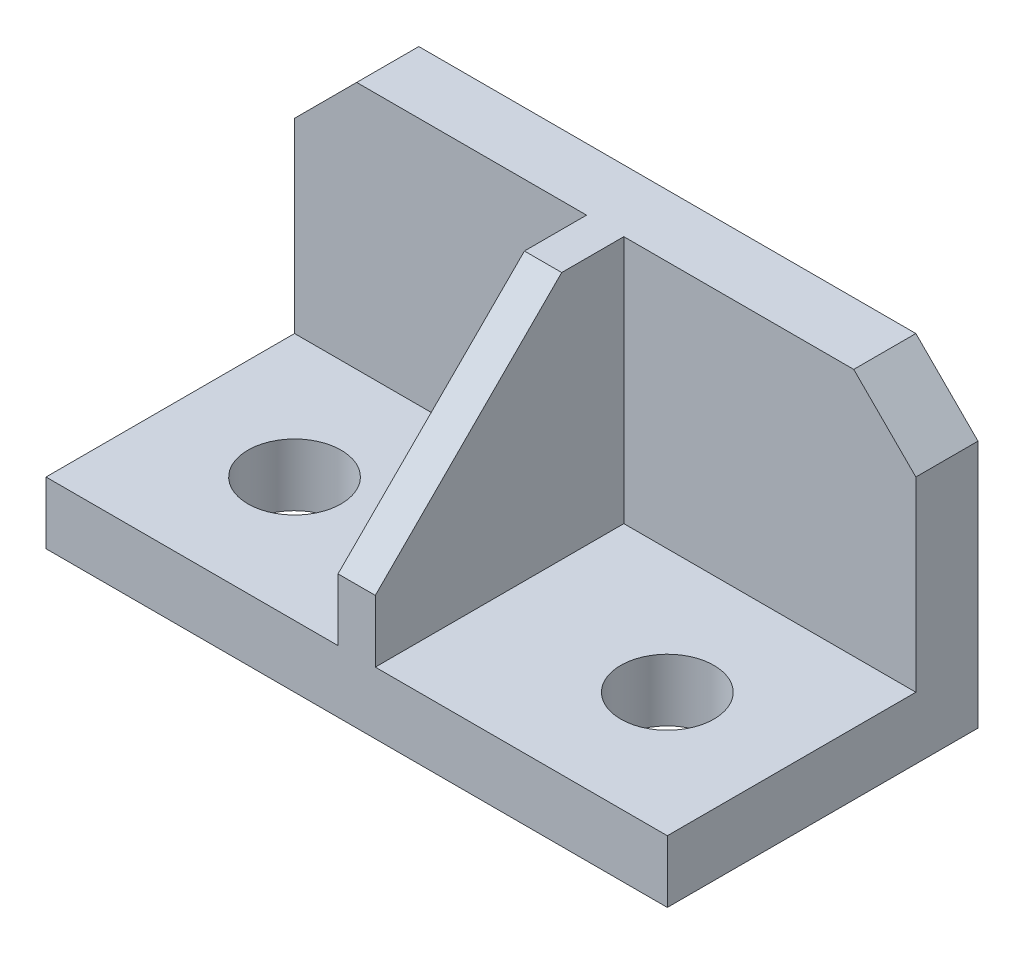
from build123d import *

# Parameters (mm, degrees)
SKETCH_1_W          = 100
SKETCH_1_H          = 50
EXTRUDE_1_DEPTH     = 50
SHELL_1_T           = -10
SKETCH_2_R          = 7.5
CUT_EXTRUDE_1_DEPTH = 119.74342087
SKETCH_3_W          = 6
SKETCH_3_H          = 40
EXTRUDE_2_DEPTH     = 40
CHAMFER_1_SIZE      = 10
CHAMFER_2_SIZE      = 30


with BuildPart() as part:
    # Sketch 1 → Extrude 1 (new body)
    with BuildSketch(Plane(origin=(0, 0, 0), x_dir=(1, 0, 0), z_dir=(0, 1, 0))):
        with Locations((50, 25)):
            Rectangle(SKETCH_1_W, SKETCH_1_H)
    extrude(amount=EXTRUDE_1_DEPTH)

    # Shell 1
    shell_1_openings = [part.faces().sort_by_distance(p)[0] for p in [
        (50, 50, -25),
        (100, 25, -25),
        (50, 25, 0),
        (0, 25, -25),
    ]]
    offset(amount=SHELL_1_T, openings=shell_1_openings, kind=Kind.INTERSECTION)

    # Sketch 2 → Cut-Extrude 1 (cut, through all)
    with BuildSketch(Plane(origin=(0, 10, 0), x_dir=(1, 0, 0), z_dir=(0, 1, 0))):
        with Locations(Location((20, 20, 0), (0, 0, 270))):
            Circle(SKETCH_2_R)
        with Locations(Location((80, 20, 0), (0, 0, 270))):
            Circle(SKETCH_2_R)
    extrude(amount=-CUT_EXTRUDE_1_DEPTH, mode=Mode.SUBTRACT)

    # Sketch 3 → Extrude 2 (add)
    with BuildSketch(Plane(origin=(0, 10, 0), x_dir=(1, 0, 0), z_dir=(0, 1, 0))):
        with Locations((50, 20)):
            Rectangle(SKETCH_3_W, SKETCH_3_H)
    extrude(amount=EXTRUDE_2_DEPTH)

    # Chamfer 1
    chamfer_1_edges = [part.edges().sort_by_distance(p)[0] for p in [
        (100, 50, -45),
        (0, 50, -45),
    ]]
    chamfer(chamfer_1_edges, length=CHAMFER_1_SIZE)

    # Chamfer 2
    chamfer_2_edges = [part.edges().sort_by_distance(p)[0] for p in [
        (50, 50, 0),
    ]]
    chamfer(chamfer_2_edges, length=CHAMFER_2_SIZE)


solid = part.part
